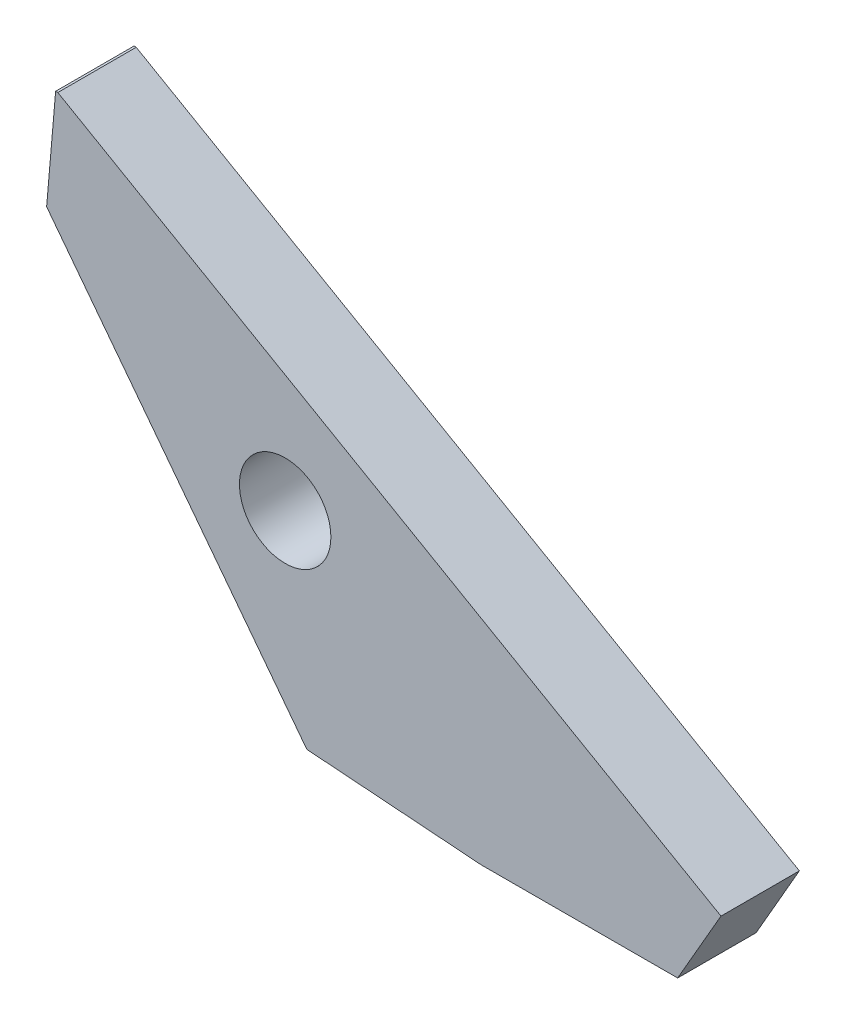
from build123d import *

# Parameters (mm, degrees)
ESQUISSE1_R        = 17.5
BOSS_EXTRU_1_DEPTH = 30


with BuildPart() as part:
    # Esquisse1 → Boss.-Extru.1 (new body)
    with BuildSketch(Plane.XY):
        Polygon((-87.006032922, 95.074854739), (166.793285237, -51), (150.218878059, -79.797380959), (75, -79.898874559), (8.3, -74.988868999), (-91.291937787, 55.074854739), (-90, 70.074854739), (-87.846770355, 95.074854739), align=None)
        Circle(ESQUISSE1_R, mode=Mode.SUBTRACT)
    extrude(amount=BOSS_EXTRU_1_DEPTH)


solid = part.part
